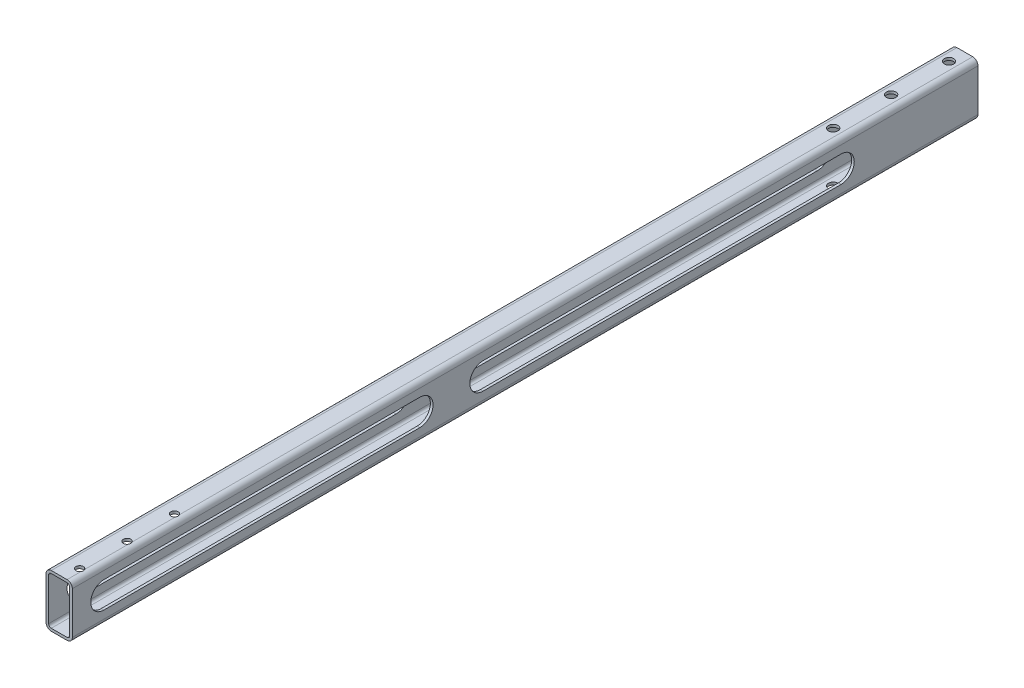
from build123d import *

# Parameters (mm, degrees)
EXTRUSION1_DEPTH        = 860
ENL_V_MAT_EXTRU_1_DEPTH = 861.726437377
ESQUISSE3_R             = 4.5
ENL_V_MAT_EXTRU_2_DEPTH = 862.542947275
ESQUISSE4_R             = 3.5
ENL_V_MAT_EXTRU_3_DEPTH = 862.542947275


with BuildPart() as part:
    # Esquisse1 → Extrusion1 (new body)
    with BuildSketch(Plane.XY):
        with BuildLine():
            Line((-12.5, 20), (-12.5, -20))
            ThreePointArc((-12.5, -20), (-11.035533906, -23.535533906), (-7.5, -25))
            Line((-7.5, -25), (7.5, -25))
            ThreePointArc((7.5, -25), (11.035533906, -23.535533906), (12.5, -20))
            Line((12.5, -20), (12.5, 20))
            ThreePointArc((12.5, 20), (11.035533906, 23.535533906), (7.5, 25))
            Line((7.5, 25), (-7.5, 25))
            ThreePointArc((-7.5, 25), (-11.035533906, 23.535533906), (-12.5, 20))
        make_face()
        with BuildLine():
            Line((-7.5, 22.5), (7.5, 22.5))
            ThreePointArc((7.5, 22.5), (9.267766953, 21.767766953), (10, 20))
            Line((10, 20), (10, -20))
            ThreePointArc((10, -20), (9.267766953, -21.767766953), (7.5, -22.5))
            Line((7.5, -22.5), (-7.5, -22.5))
            ThreePointArc((-7.5, -22.5), (-9.267766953, -21.767766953), (-10, -20))
            Line((-10, -20), (-10, 20))
            ThreePointArc((-10, 20), (-9.267766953, 21.767766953), (-7.5, 22.5))
        make_face(mode=Mode.SUBTRACT)
    extrude(amount=EXTRUSION1_DEPTH)

    # Esquisse2 → Enl_v. mat.-Extru.1 (cut, through all)
    with BuildSketch(Plane.ZY.offset(12.5)):
        with BuildLine():
            Line((470, 12.5), (130, 12.5))
            ThreePointArc((130, 12.5), (117.5, 0), (130, -12.5))
            Line((130, -12.5), (470, -12.5))
            ThreePointArc((470, -12.5), (482.5, 0), (470, 12.5))
        make_face()
        with BuildLine():
            Line((530, 12.5), (830, 12.5))
            ThreePointArc((830, 12.5), (842.5, 0), (830, -12.5))
            Line((830, -12.5), (530, -12.5))
            ThreePointArc((530, -12.5), (517.5, 0), (530, 12.5))
        make_face()
    extrude(amount=-ENL_V_MAT_EXTRU_1_DEPTH, mode=Mode.SUBTRACT)

    # Esquisse3 → Enl_v. mat.-Extru.2 (cut, through all)
    with BuildSketch(Plane(origin=(0, 25, 0), x_dir=(-1, 0, 0), z_dir=(0, 1, 0))):
        with Locations((0, 15)):
            Circle(ESQUISSE3_R)
        with Locations((0, 70)):
            Circle(ESQUISSE3_R)
        with Locations((0, 125)):
            Circle(ESQUISSE3_R)
    extrude(amount=-ENL_V_MAT_EXTRU_2_DEPTH, mode=Mode.SUBTRACT)

    # Esquisse4 → Enl_v. mat.-Extru.3 (cut, through all)
    with BuildSketch(Plane(origin=(0, 25, 0), x_dir=(-1, 0, 0), z_dir=(0, 1, 0))):
        with Locations(Location((-4.5, 845, 0), (0, 0, 148.997280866))):
            Circle(ESQUISSE4_R)
        with Locations(Location((-4.5, 800, 0), (0, 0, 148.997280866))):
            Circle(ESQUISSE4_R)
        with Locations(Location((-4.5, 755, 0), (0, 0, 148.997280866))):
            Circle(ESQUISSE4_R)
    extrude(amount=-ENL_V_MAT_EXTRU_3_DEPTH, mode=Mode.SUBTRACT)


solid = part.part
